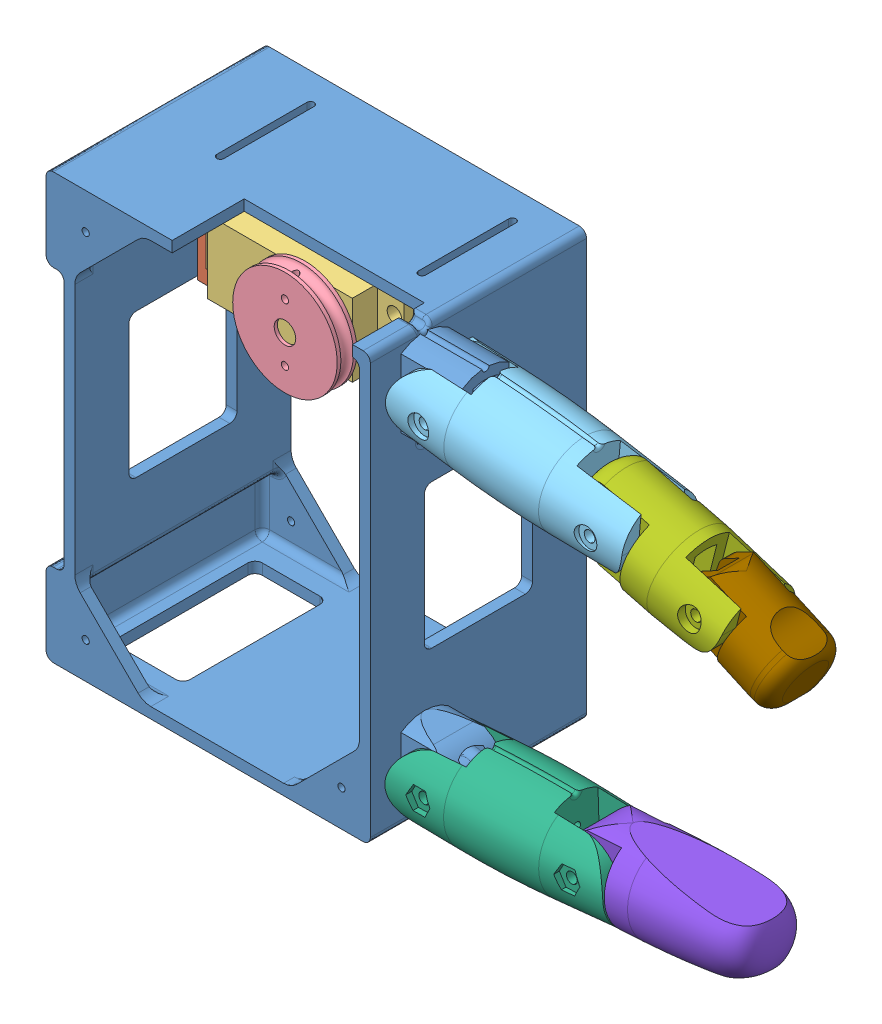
SolidWorks assembly 1SI_Challenge0_v2.SLDASM, configuration Défaut (file format 9000). Lengths in mm.
Overall size (207.57 118.5 60).
9 component instances, 9 part files, 20 mates.
Components (placement in the parent):
- SupportPince_v2-1: SupportPince_v2.SLDPRT [Défaut] at (-48.3649 -70.8044 -30) size (107 118 60)
- SupportServo_v2-1: SupportServo_v2.SLDPRT [Défaut] at (-56.3649 44.1956 5) x (1 0 0) z (0 -1 0) size (65 25 28)
- ServoHK15298-1: ServoHK15298.SLDPRT [Défaut] at (-108.5649 43.2956 -21.4) x (1 0 0) z (0 -1 0) size (55 43 20.2)
- PoulieTreuil-1: PoulieTreuil.SLDPRT [Défaut] at (-79.5649 33.1956 22.5) x (1 0 0) z (0 0 -1) size (29 29 5.5)
- Phalange1Index_v2-1: Phalange1Index_v2.SLDPRT [Défaut] at (-17.8968 31.9022 14.95) x (0.995712 -0.092511 0) z (0 0 1) size (65 25.58 24.46)
- Phalange1Pouce_v2-1: Phalange1Pouce_v2.SLDPRT [Défaut] at (-17.856 -56.7468 15.05) x (0.999477 0.032333 0) z (0 0 -1) size (60 25.24 24.45)
- Phalange2Index-1: Phalange2Index.SLDPRT [Défaut] at (23.9727 24.9829 15) x (0.969037 -0.246914 0) z (0 0 1) size (44.82 21.45 22.9)
- Phalange2Pouce-1: Phalange2Pouce.SLDPRT [Défaut] at (19.5945 -54.6335 15.1) x (0.997932 0.064273 0) z (0 0 -1) size (59.04 27.99 26.13)
- Phalange3Index_v2-1: Phalange3Index_v2.SLDPRT [Défaut] at (52.9094 16.1374 15.05) x (0.9122 -0.409746 0) z (0 0 1) size (30.79 20 20)
Mates (geometry in assembly coordinates):
- Coïncidente1: coincident anti-aligned: plane of SupportPince_v2-1 through (-51.3649 44.1956 30) normal (0 -1 0); plane of SupportServo_v2-1 through (-56.3649 44.1956 5) normal (0 1 0)
- Coïncidente2: coincident anti-aligned: plane of SupportPince_v2-1 through (-56.3649 42.1956 10) normal (-1 0 0); plane of SupportServo_v2-1 through (-56.3649 41.1956 5) normal (1 0 0)
- Distance1: distance = 5 mm aligned: plane of SupportServo_v2-1 through (-56.3649 41.1956 5) normal (0 0 1); plane of SupportPince_v2-1 through (-53.3649 -70.8054 10) normal (0 0 1)
- Coaxiale1: concentric anti-aligned: cylinder of ServoHK15298-1 through (-79.5649 33.1956 21.6) axis (0 0 -1) radius 3; cylinder of PoulieTreuil-1 through (-79.5649 33.1956 17) axis (0 0 1) radius 3
- Distance2: distance = 2 mm anti-aligned: plane of PoulieTreuil-1 through (-79.5649 33.1956 17) normal (0 0 -1); plane of ServoHK15298-1 through (-108.5649 23.0956 15) normal (0 0 1)
- Coïncidente4: coincident anti-aligned: plane of SupportServo_v2-1 through (-56.3649 41.1956 5) normal (0 0 1); plane of ServoHK15298-1 through (-68.3649 23.0956 5) normal (0 0 -1)
- Coïncidente5: coincident anti-aligned: plane of SupportServo_v2-1 through (-68.3649 16.1956 5) normal (-1 0 0); plane of ServoHK15298-1 through (-68.3649 23.0956 -21.4) normal (1 0 0)
- Distance4: distance = 0.9 mm: plane of ServoHK15298-1 through (-108.5649 43.2956 -21.4) normal (0 1 0); line of SupportServo_v2-1 through (-109.3649 44.1956 5) axis (-1 0 0)
- Coaxiale2: concentric aligned: cylinder of SupportPince_v2-1 through (-38.3649 33.1956 -30) axis (0 0 1) radius 1.25; cylinder of Phalange1Index_v2-1 through (-38.3649 33.1956 2.45) axis (0 0 1) radius 1.5
- Coïncidente6: coincident anti-aligned: plane of SupportPince_v2-1 through (-29.8649 43.1825 21.5) normal (0 0 1); plane of Phalange1Index_v2-1 through (-48.9245 22.2311 21.5) normal (0 0 -1)
- Coaxiale4: concentric anti-aligned: cylinder of SupportPince_v2-1 through (-38.3649 -56.8044 -30) axis (0 0 1) radius 1.25; cylinder of Phalange1Pouce_v2-1 through (-38.3649 -56.8044 27.55) axis (0 0 -1) radius 1.5
- Coïncidente8: coincident anti-aligned: plane of SupportPince_v2-1 through (-29.8649 -66.7912 8.5) normal (0 0 -1); plane of Phalange1Pouce_v2-1 through (-48.2445 -45.2234 8.5) normal (0 0 1)
- Coaxiale5: concentric aligned: cylinder of Phalange1Index_v2-1 through (7.4378 28.9401 2.45) axis (0 0 1) radius 1.5; cylinder of Phalange2Index-1 through (7.4378 28.9401 3.55) axis (0 0 1) radius 1.25
- Coïncidente9: coincident anti-aligned: plane of Phalange1Index_v2-1 through (15.7967 16.2179 21) normal (0 0 -1); plane of Phalange2Index-1 through (-3.0804 20.0603 21) normal (0 0 1)
- Coaxiale6: concentric aligned: cylinder of Phalange1Pouce_v2-1 through (2.6137 -55.4787 27.55) axis (0 0 -1) radius 1.5; cylinder of Phalange2Pouce-1 through (2.6137 -55.4787 26.55) axis (0 0 -1) radius 1.25
- Coïncidente10: coincident anti-aligned: plane of Phalange1Pouce_v2-1 through (11.7241 -43.2834 21.1) normal (0 0 -1); plane of Phalange2Pouce-1 through (-6.0898 -44.814 21.1) normal (0 0 1)
- Coaxiale7: concentric aligned: cylinder of Phalange2Index-1 through (36.0338 23.7177 3.55) axis (0 0 1) radius 1.5; cylinder of Phalange3Index_v2-1 through (36.0338 23.7177 5.05) axis (0 0 1) radius 1.25
- Coïncidente11: coincident anti-aligned: plane of Phalange2Index-1 through (40.5263 8.9491 21.05) normal (0 0 -1); plane of Phalange3Index_v2-1 through (25.0948 17.6688 21.05) normal (0 0 1)
- Tangent1: tangent: plane of Phalange2Pouce-1 through (9.6261 -43.8018 26.55) normal (0.091916 0.995767 0); circle of assembly
- Tangent2: tangent: plane of Phalange3Index_v2-1 through (55.1936 9.0198 5.05) normal (-0.20175 -0.979437 0); circle of assembly
